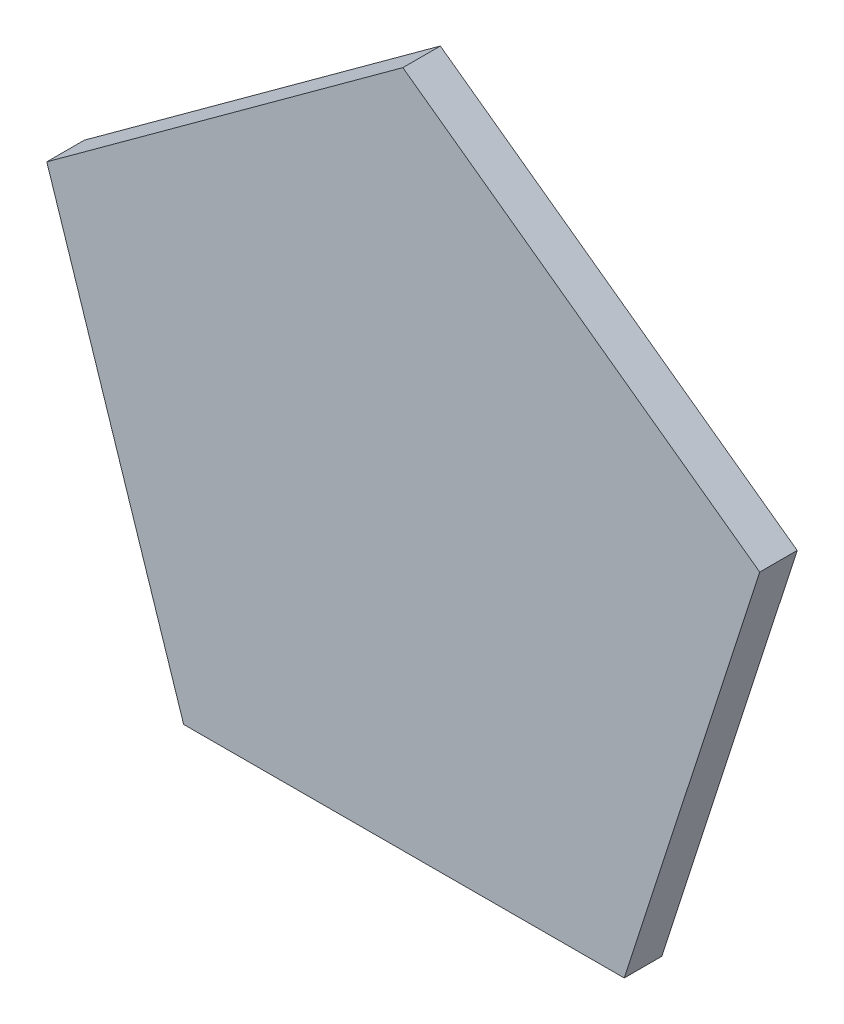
ISO-10303-21;
HEADER;
FILE_DESCRIPTION(('STEP AP214'),'2;1');
FILE_NAME('part.step','',(''),(''),'','','');
FILE_SCHEMA(('AUTOMOTIVE_DESIGN { 1 0 10303 214 1 1 1 1 }'));
ENDSEC;
DATA;
#1=APPLICATION_CONTEXT('core data for automotive mechanical design processes');
#2=APPLICATION_PROTOCOL_DEFINITION('international standard','automotive_design',2000,#1);
#3=PRODUCT_CONTEXT('',#1,'mechanical');
#4=PRODUCT('Part','Part','',(#3));
#5=PRODUCT_RELATED_PRODUCT_CATEGORY('part','',(#4));
#6=PRODUCT_DEFINITION_FORMATION('','',#4);
#7=PRODUCT_DEFINITION_CONTEXT('part definition',#1,'design');
#8=PRODUCT_DEFINITION('design','',#6,#7);
#9=PRODUCT_DEFINITION_SHAPE('','',#8);
#10=(LENGTH_UNIT() NAMED_UNIT(*) SI_UNIT(.MILLI.,.METRE.));
#11=(NAMED_UNIT(*) PLANE_ANGLE_UNIT() SI_UNIT($,.RADIAN.));
#12=(NAMED_UNIT(*) SI_UNIT($,.STERADIAN.) SOLID_ANGLE_UNIT());
#13=UNCERTAINTY_MEASURE_WITH_UNIT(LENGTH_MEASURE(1.E-05),#10,'distance_accuracy_value','');
#14=(GEOMETRIC_REPRESENTATION_CONTEXT(3) GLOBAL_UNCERTAINTY_ASSIGNED_CONTEXT((#13)) GLOBAL_UNIT_ASSIGNED_CONTEXT((#10,
#11,#12)) REPRESENTATION_CONTEXT('',''));
#15=CARTESIAN_POINT('',(0.,0.,0.));
#16=DIRECTION('',(0.,0.,1.));
#17=DIRECTION('',(1.,0.,0.));
#18=AXIS2_PLACEMENT_3D('',#15,#16,#17);
#19=CARTESIAN_POINT('',(-5.8645817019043,-8.09979514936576,1.));
#20=DIRECTION('',(-0.00163938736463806,0.999998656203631,0.));
#21=DIRECTION('',(-0.999998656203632,-0.00163938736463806,0.));
#22=AXIS2_PLACEMENT_3D('',#19,#20,#21);
#23=PLANE('',#22);
#24=DIRECTION('',(0.999998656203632,0.00163938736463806,0.));
#25=VECTOR('',#24,1.);
#26=CARTESIAN_POINT('',(-5.8645817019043,-8.09979514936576,0.));
#27=LINE('',#26,#25);
#28=CARTESIAN_POINT('',(-5.8645817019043,-8.09979514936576,0.));
#29=VERTEX_POINT('',#28);
#30=CARTESIAN_POINT('',(5.89110754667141,-8.08052299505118,0.));
#31=VERTEX_POINT('',#30);
#32=EDGE_CURVE('E295',#29,#31,#27,.T.);
#33=ORIENTED_EDGE('',*,*,#32,.T.);
#34=DIRECTION('',(0.,0.,-1.));
#35=VECTOR('',#34,1.);
#36=CARTESIAN_POINT('',(5.89110754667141,-8.08052299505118,1.));
#37=LINE('',#36,#35);
#38=CARTESIAN_POINT('',(5.89110754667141,-8.08052299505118,1.));
#39=VERTEX_POINT('',#38);
#40=EDGE_CURVE('E11',#39,#31,#37,.T.);
#41=ORIENTED_EDGE('',*,*,#40,.F.);
#42=DIRECTION('',(0.999998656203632,0.00163938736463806,0.));
#43=VECTOR('',#42,1.);
#44=CARTESIAN_POINT('',(-5.8645817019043,-8.09979514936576,1.));
#45=LINE('',#44,#43);
#46=CARTESIAN_POINT('',(-5.8645817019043,-8.09979514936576,1.));
#47=VERTEX_POINT('',#46);
#48=EDGE_CURVE('E300',#47,#39,#45,.T.);
#49=ORIENTED_EDGE('',*,*,#48,.F.);
#50=DIRECTION('',(0.,0.,-1.));
#51=VECTOR('',#50,1.);
#52=CARTESIAN_POINT('',(-5.8645817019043,-8.09979514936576,1.));
#53=LINE('',#52,#51);
#54=EDGE_CURVE('E312',#47,#29,#53,.T.);
#55=ORIENTED_EDGE('',*,*,#54,.T.);
#56=EDGE_LOOP('',(#33,#41,#49,#55));
#57=FACE_BOUND('',#56,.T.);
#58=ADVANCED_FACE('F39',(#57),#23,.F.);
#59=CARTESIAN_POINT('',(5.89110754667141,-8.08052299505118,1.));
#60=DIRECTION('',(-0.951561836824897,0.307457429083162,0.));
#61=DIRECTION('',(-0.307457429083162,-0.951561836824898,0.));
#62=AXIS2_PLACEMENT_3D('',#59,#60,#61);
#63=PLANE('',#62);
#64=DIRECTION('',(0.307457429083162,0.951561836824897,0.));
#65=VECTOR('',#64,1.);
#66=CARTESIAN_POINT('',(5.89110754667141,-8.08052299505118,0.));
#67=LINE('',#66,#65);
#68=CARTESIAN_POINT('',(9.50548639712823,3.10575729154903,0.));
#69=VERTEX_POINT('',#68);
#70=EDGE_CURVE('E315',#31,#69,#67,.T.);
#71=ORIENTED_EDGE('',*,*,#70,.T.);
#72=DIRECTION('',(0.,0.,-1.));
#73=VECTOR('',#72,1.);
#74=CARTESIAN_POINT('',(9.50548639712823,3.10575729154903,1.));
#75=LINE('',#74,#73);
#76=CARTESIAN_POINT('',(9.50548639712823,3.10575729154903,1.));
#77=VERTEX_POINT('',#76);
#78=EDGE_CURVE('E46',#77,#69,#75,.T.);
#79=ORIENTED_EDGE('',*,*,#78,.F.);
#80=DIRECTION('',(0.307457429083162,0.951561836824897,0.));
#81=VECTOR('',#80,1.);
#82=CARTESIAN_POINT('',(5.89110754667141,-8.08052299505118,1.));
#83=LINE('',#82,#81);
#84=EDGE_CURVE('E303',#39,#77,#83,.T.);
#85=ORIENTED_EDGE('',*,*,#84,.F.);
#86=ORIENTED_EDGE('',*,*,#40,.T.);
#87=EDGE_LOOP('',(#71,#79,#85,#86));
#88=FACE_BOUND('',#87,.T.);
#89=ADVANCED_FACE('F353',(#88),#63,.F.);
#90=CARTESIAN_POINT('',(9.50548639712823,3.10575729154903,1.));
#91=DIRECTION('',(-0.58645817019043,-0.809979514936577,0.));
#92=DIRECTION('',(0.809979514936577,-0.58645817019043,0.));
#93=AXIS2_PLACEMENT_3D('',#90,#91,#92);
#94=PLANE('',#93);
#95=DIRECTION('',(-0.809979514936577,0.58645817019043,0.));
#96=VECTOR('',#95,1.);
#97=CARTESIAN_POINT('',(9.50548639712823,3.10575729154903,0.));
#98=LINE('',#97,#96);
#99=CARTESIAN_POINT('',(-0.0163938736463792,9.99998656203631,0.));
#100=VERTEX_POINT('',#99);
#101=EDGE_CURVE('E317',#69,#100,#98,.T.);
#102=ORIENTED_EDGE('',*,*,#101,.T.);
#103=DIRECTION('',(0.,0.,-1.));
#104=VECTOR('',#103,1.);
#105=CARTESIAN_POINT('',(-0.0163938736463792,9.99998656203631,1.));
#106=LINE('',#105,#104);
#107=CARTESIAN_POINT('',(-0.0163938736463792,9.99998656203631,1.));
#108=VERTEX_POINT('',#107);
#109=EDGE_CURVE('E327',#108,#100,#106,.T.);
#110=ORIENTED_EDGE('',*,*,#109,.F.);
#111=DIRECTION('',(-0.809979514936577,0.58645817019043,0.));
#112=VECTOR('',#111,1.);
#113=CARTESIAN_POINT('',(9.50548639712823,3.10575729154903,1.));
#114=LINE('',#113,#112);
#115=EDGE_CURVE('E306',#77,#108,#114,.T.);
#116=ORIENTED_EDGE('',*,*,#115,.F.);
#117=ORIENTED_EDGE('',*,*,#78,.T.);
#118=EDGE_LOOP('',(#102,#110,#116,#117));
#119=FACE_BOUND('',#118,.T.);
#120=ADVANCED_FACE('F334',(#119),#94,.F.);
#121=CARTESIAN_POINT('',(-0.0163938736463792,9.99998656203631,1.));
#122=DIRECTION('',(0.589110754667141,-0.80805229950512,0.));
#123=DIRECTION('',(0.80805229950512,0.589110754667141,0.));
#124=AXIS2_PLACEMENT_3D('',#121,#122,#123);
#125=PLANE('',#124);
#126=DIRECTION('',(-0.80805229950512,-0.589110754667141,0.));
#127=VECTOR('',#126,1.);
#128=CARTESIAN_POINT('',(-0.0163938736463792,9.99998656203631,0.));
#129=LINE('',#128,#127);
#130=CARTESIAN_POINT('',(-9.51561836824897,3.07457429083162,0.));
#131=VERTEX_POINT('',#130);
#132=EDGE_CURVE('E319',#100,#131,#129,.T.);
#133=ORIENTED_EDGE('',*,*,#132,.T.);
#134=DIRECTION('',(0.,0.,-1.));
#135=VECTOR('',#134,1.);
#136=CARTESIAN_POINT('',(-9.51561836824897,3.07457429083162,1.));
#137=LINE('',#136,#135);
#138=CARTESIAN_POINT('',(-9.51561836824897,3.07457429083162,1.));
#139=VERTEX_POINT('',#138);
#140=EDGE_CURVE('E324',#139,#131,#137,.T.);
#141=ORIENTED_EDGE('',*,*,#140,.F.);
#142=DIRECTION('',(-0.80805229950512,-0.589110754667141,0.));
#143=VECTOR('',#142,1.);
#144=CARTESIAN_POINT('',(-0.0163938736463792,9.99998656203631,1.));
#145=LINE('',#144,#143);
#146=EDGE_CURVE('E308',#108,#139,#145,.T.);
#147=ORIENTED_EDGE('',*,*,#146,.F.);
#148=ORIENTED_EDGE('',*,*,#109,.T.);
#149=EDGE_LOOP('',(#133,#141,#147,#148));
#150=FACE_BOUND('',#149,.T.);
#151=ADVANCED_FACE('F343',(#150),#125,.F.);
#152=CARTESIAN_POINT('',(-9.51561836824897,3.07457429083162,1.));
#153=DIRECTION('',(0.950548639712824,0.310575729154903,0.));
#154=DIRECTION('',(-0.310575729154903,0.950548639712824,0.));
#155=AXIS2_PLACEMENT_3D('',#152,#153,#154);
#156=PLANE('',#155);
#157=DIRECTION('',(0.310575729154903,-0.950548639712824,0.));
#158=VECTOR('',#157,1.);
#159=CARTESIAN_POINT('',(-9.51561836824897,3.07457429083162,0.));
#160=LINE('',#159,#158);
#161=EDGE_CURVE('E304',#131,#29,#160,.T.);
#162=ORIENTED_EDGE('',*,*,#161,.T.);
#163=ORIENTED_EDGE('',*,*,#54,.F.);
#164=DIRECTION('',(0.310575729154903,-0.950548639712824,0.));
#165=VECTOR('',#164,1.);
#166=CARTESIAN_POINT('',(-9.51561836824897,3.07457429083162,1.));
#167=LINE('',#166,#165);
#168=EDGE_CURVE('E310',#139,#47,#167,.T.);
#169=ORIENTED_EDGE('',*,*,#168,.F.);
#170=ORIENTED_EDGE('',*,*,#140,.T.);
#171=EDGE_LOOP('',(#162,#163,#169,#170));
#172=FACE_BOUND('',#171,.T.);
#173=ADVANCED_FACE('F347',(#172),#156,.F.);
#174=CARTESIAN_POINT('',(0.,0.,1.));
#175=DIRECTION('',(0.,0.,1.));
#176=DIRECTION('',(1.,0.,0.));
#177=AXIS2_PLACEMENT_3D('',#174,#175,#176);
#178=PLANE('',#177);
#179=ORIENTED_EDGE('',*,*,#48,.T.);
#180=ORIENTED_EDGE('',*,*,#84,.T.);
#181=ORIENTED_EDGE('',*,*,#115,.T.);
#182=ORIENTED_EDGE('',*,*,#146,.T.);
#183=ORIENTED_EDGE('',*,*,#168,.T.);
#184=EDGE_LOOP('',(#179,#180,#181,#182,#183));
#185=FACE_BOUND('',#184,.T.);
#186=ADVANCED_FACE('F351',(#185),#178,.T.);
#187=CARTESIAN_POINT('',(0.,0.,0.));
#188=DIRECTION('',(0.,0.,1.));
#189=DIRECTION('',(1.,0.,0.));
#190=AXIS2_PLACEMENT_3D('',#187,#188,#189);
#191=PLANE('',#190);
#192=DIRECTION('',(-0.314920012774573,0.949118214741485,0.));
#193=VECTOR('',#192,1.);
#194=CARTESIAN_POINT('',(0.199275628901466,9.34999340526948,0.));
#195=LINE('',#194,#193);
#196=CARTESIAN_POINT('',(2.24303910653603,3.19041934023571,0.));
#197=VERTEX_POINT('',#196);
#198=CARTESIAN_POINT('',(0.199275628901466,9.34999340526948,0.));
#199=VERTEX_POINT('',#198);
#200=EDGE_CURVE('E242',#197,#199,#195,.T.);
#201=ORIENTED_EDGE('',*,*,#200,.F.);
#202=DIRECTION('',(-0.999932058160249,0.0116567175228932,0.));
#203=VECTOR('',#202,1.);
#204=CARTESIAN_POINT('',(2.24303910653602,3.19041934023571,0.));
#205=LINE('',#204,#203);
#206=CARTESIAN_POINT('',(8.81226450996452,3.11383853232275,0.));
#207=VERTEX_POINT('',#206);
#208=EDGE_CURVE('E53',#207,#197,#205,.T.);
#209=ORIENTED_EDGE('',*,*,#208,.F.);
#210=DIRECTION('',(0.809979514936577,-0.58645817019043,0.));
#211=VECTOR('',#210,1.);
#212=CARTESIAN_POINT('',(0.199275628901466,9.34999340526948,0.));
#213=LINE('',#212,#211);
#214=EDGE_CURVE('E239',#199,#207,#213,.T.);
#215=ORIENTED_EDGE('',*,*,#214,.F.);
#216=EDGE_LOOP('',(#201,#209,#215));
#217=FACE_BOUND('',#216,.T.);
#218=DIRECTION('',(-0.307457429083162,-0.951561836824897,0.));
#219=VECTOR('',#218,1.);
#220=CARTESIAN_POINT('',(8.94398759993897,2.66894616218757,0.));
#221=LINE('',#220,#219);
#222=CARTESIAN_POINT('',(8.94398759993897,2.66894616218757,0.));
#223=VERTEX_POINT('',#222);
#224=CARTESIAN_POINT('',(5.67368158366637,-7.45244986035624,0.));
#225=VERTEX_POINT('',#224);
#226=EDGE_CURVE('E264',#223,#225,#221,.T.);
#227=ORIENTED_EDGE('',*,*,#226,.F.);
#228=DIRECTION('',(0.789291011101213,0.614019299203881,0.));
#229=VECTOR('',#228,1.);
#230=CARTESIAN_POINT('',(8.94398759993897,2.66894616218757,0.));
#231=LINE('',#230,#229);
#232=CARTESIAN_POINT('',(3.60711496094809,-1.48280870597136,0.));
#233=VERTEX_POINT('',#232);
#234=EDGE_CURVE('E61',#233,#223,#231,.T.);
#235=ORIENTED_EDGE('',*,*,#234,.F.);
#236=DIRECTION('',(-0.327132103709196,0.944978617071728,0.));
#237=VECTOR('',#236,1.);
#238=CARTESIAN_POINT('',(3.60711496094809,-1.48280870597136,0.));
#239=LINE('',#238,#237);
#240=EDGE_CURVE('E261',#225,#233,#239,.T.);
#241=ORIENTED_EDGE('',*,*,#240,.F.);
#242=EDGE_LOOP('',(#227,#235,#241));
#243=FACE_BOUND('',#242,.T.);
#244=DIRECTION('',(-0.322888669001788,-0.946436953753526,0.));
#245=VECTOR('',#244,1.);
#246=CARTESIAN_POINT('',(-5.64963130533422,-7.46974207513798,0.));
#247=LINE('',#246,#245);
#248=CARTESIAN_POINT('',(-3.60711496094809,-1.48280870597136,0.));
#249=VERTEX_POINT('',#248);
#250=CARTESIAN_POINT('',(-5.64963130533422,-7.46974207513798,0.));
#251=VERTEX_POINT('',#250);
#252=EDGE_CURVE('E193',#249,#251,#247,.T.);
#253=ORIENTED_EDGE('',*,*,#252,.F.);
#254=DIRECTION('',(0.791821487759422,-0.610752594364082,0.));
#255=VECTOR('',#254,1.);
#256=CARTESIAN_POINT('',(-3.60711496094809,-1.48280870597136,0.));
#257=LINE('',#256,#255);
#258=CARTESIAN_POINT('',(-8.95302529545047,2.64063155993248,0.));
#259=VERTEX_POINT('',#258);
#260=EDGE_CURVE('E178',#259,#249,#257,.T.);
#261=ORIENTED_EDGE('',*,*,#260,.F.);
#262=DIRECTION('',(-0.310575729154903,0.950548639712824,0.));
#263=VECTOR('',#262,1.);
#264=CARTESIAN_POINT('',(-5.64963130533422,-7.46974207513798,0.));
#265=LINE('',#264,#263);
#266=EDGE_CURVE('E188',#251,#259,#265,.T.);
#267=ORIENTED_EDGE('',*,*,#266,.F.);
#268=EDGE_LOOP('',(#253,#261,#267));
#269=FACE_BOUND('',#268,.T.);
#270=DIRECTION('',(0.815524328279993,-0.578722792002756,0.));
#271=VECTOR('',#270,1.);
#272=CARTESIAN_POINT('',(5.32873415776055,-7.68144440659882,0.));
#273=LINE('',#272,#271);
#274=CARTESIAN_POINT('',(0.,-3.9,0.));
#275=VERTEX_POINT('',#274);
#276=CARTESIAN_POINT('',(5.32873415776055,-7.68144440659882,0.));
#277=VERTEX_POINT('',#276);
#278=EDGE_CURVE('E218',#275,#277,#273,.T.);
#279=ORIENTED_EDGE('',*,*,#278,.F.);
#280=DIRECTION('',(0.813024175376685,0.58222992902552,0.));
#281=VECTOR('',#280,1.);
#282=CARTESIAN_POINT('',(0.,-3.9,0.));
#283=LINE('',#282,#281);
#284=CARTESIAN_POINT('',(-5.30474050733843,-7.69887681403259,0.));
#285=VERTEX_POINT('',#284);
#286=EDGE_CURVE('E222',#285,#275,#283,.T.);
#287=ORIENTED_EDGE('',*,*,#286,.F.);
#288=DIRECTION('',(-0.999998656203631,-0.00163938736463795,0.));
#289=VECTOR('',#288,1.);
#290=CARTESIAN_POINT('',(5.32873415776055,-7.68144440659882,0.));
#291=LINE('',#290,#289);
#292=EDGE_CURVE('E215',#277,#285,#291,.T.);
#293=ORIENTED_EDGE('',*,*,#292,.F.);
#294=EDGE_LOOP('',(#279,#287,#293));
#295=FACE_BOUND('',#294,.T.);
#296=DIRECTION('',(0.80805229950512,0.589110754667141,0.));
#297=VECTOR('',#296,1.);
#298=CARTESIAN_POINT('',(-8.82146228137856,3.08563151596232,0.));
#299=LINE('',#298,#297);
#300=CARTESIAN_POINT('',(-8.82146228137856,3.08563151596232,0.));
#301=VERTEX_POINT('',#300);
#302=CARTESIAN_POINT('',(-0.228923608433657,9.35002423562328,0.));
#303=VERTEX_POINT('',#302);
#304=EDGE_CURVE('E288',#301,#303,#299,.T.);
#305=ORIENTED_EDGE('',*,*,#304,.F.);
#306=DIRECTION('',(-0.999873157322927,-0.0159269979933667,0.));
#307=VECTOR('',#306,1.);
#308=CARTESIAN_POINT('',(-8.82146228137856,3.08563151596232,0.));
#309=LINE('',#308,#307);
#310=CARTESIAN_POINT('',(-2.24303910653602,3.19041934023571,0.));
#311=VERTEX_POINT('',#310);
#312=EDGE_CURVE('E247',#311,#301,#309,.T.);
#313=ORIENTED_EDGE('',*,*,#312,.F.);
#314=DIRECTION('',(-0.31079441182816,-0.950477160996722,0.));
#315=VECTOR('',#314,1.);
#316=CARTESIAN_POINT('',(-2.24303910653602,3.19041934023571,0.));
#317=LINE('',#316,#315);
#318=EDGE_CURVE('E280',#303,#311,#317,.T.);
#319=ORIENTED_EDGE('',*,*,#318,.F.);
#320=EDGE_LOOP('',(#305,#313,#319));
#321=FACE_BOUND('',#320,.T.);
#322=ORIENTED_EDGE('',*,*,#32,.F.);
#323=ORIENTED_EDGE('',*,*,#161,.F.);
#324=ORIENTED_EDGE('',*,*,#132,.F.);
#325=ORIENTED_EDGE('',*,*,#101,.F.);
#326=ORIENTED_EDGE('',*,*,#70,.F.);
#327=EDGE_LOOP('',(#322,#323,#324,#325,#326));
#328=FACE_BOUND('',#327,.T.);
#329=ADVANCED_FACE('F195',(#217,#243,#269,#295,#321,#328),#191,.F.);
#330=CARTESIAN_POINT('',(-8.82146228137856,3.08563151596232,0.5));
#331=DIRECTION('',(0.0159269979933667,-0.999873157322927,0.));
#332=DIRECTION('',(0.999873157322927,0.0159269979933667,0.));
#333=AXIS2_PLACEMENT_3D('',#330,#331,#332);
#334=PLANE('',#333);
#335=ORIENTED_EDGE('',*,*,#312,.T.);
#336=DIRECTION('',(0.,0.,-1.));
#337=VECTOR('',#336,1.);
#338=CARTESIAN_POINT('',(-8.82146228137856,3.08563151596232,0.5));
#339=LINE('',#338,#337);
#340=CARTESIAN_POINT('',(-8.82146228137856,3.08563151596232,0.5));
#341=VERTEX_POINT('',#340);
#342=EDGE_CURVE('E286',#341,#301,#339,.T.);
#343=ORIENTED_EDGE('',*,*,#342,.F.);
#344=DIRECTION('',(-0.999873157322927,-0.0159269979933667,0.));
#345=VECTOR('',#344,1.);
#346=CARTESIAN_POINT('',(-8.82146228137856,3.08563151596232,0.5));
#347=LINE('',#346,#345);
#348=CARTESIAN_POINT('',(-2.24303910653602,3.19041934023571,0.5));
#349=VERTEX_POINT('',#348);
#350=EDGE_CURVE('E276',#349,#341,#347,.T.);
#351=ORIENTED_EDGE('',*,*,#350,.F.);
#352=DIRECTION('',(0.,0.,-1.));
#353=VECTOR('',#352,1.);
#354=CARTESIAN_POINT('',(-2.24303910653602,3.19041934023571,0.5));
#355=LINE('',#354,#353);
#356=EDGE_CURVE('E293',#349,#311,#355,.T.);
#357=ORIENTED_EDGE('',*,*,#356,.T.);
#358=EDGE_LOOP('',(#335,#343,#351,#357));
#359=FACE_BOUND('',#358,.T.);
#360=ADVANCED_FACE('F370',(#359),#334,.F.);
#361=CARTESIAN_POINT('',(-2.24303910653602,3.19041934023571,0.5));
#362=DIRECTION('',(0.950477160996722,-0.31079441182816,0.));
#363=DIRECTION('',(0.31079441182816,0.950477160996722,0.));
#364=AXIS2_PLACEMENT_3D('',#361,#362,#363);
#365=PLANE('',#364);
#366=ORIENTED_EDGE('',*,*,#318,.T.);
#367=ORIENTED_EDGE('',*,*,#356,.F.);
#368=DIRECTION('',(-0.31079441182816,-0.950477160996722,0.));
#369=VECTOR('',#368,1.);
#370=CARTESIAN_POINT('',(-2.24303910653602,3.19041934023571,0.5));
#371=LINE('',#370,#369);
#372=CARTESIAN_POINT('',(-0.228923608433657,9.35002423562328,0.5));
#373=VERTEX_POINT('',#372);
#374=EDGE_CURVE('E283',#373,#349,#371,.T.);
#375=ORIENTED_EDGE('',*,*,#374,.F.);
#376=DIRECTION('',(0.,0.,-1.));
#377=VECTOR('',#376,1.);
#378=CARTESIAN_POINT('',(-0.228923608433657,9.35002423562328,0.5));
#379=LINE('',#378,#377);
#380=EDGE_CURVE('E296',#373,#303,#379,.T.);
#381=ORIENTED_EDGE('',*,*,#380,.T.);
#382=EDGE_LOOP('',(#366,#367,#375,#381));
#383=FACE_BOUND('',#382,.T.);
#384=ADVANCED_FACE('F376',(#383),#365,.F.);
#385=CARTESIAN_POINT('',(-8.82146228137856,3.08563151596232,0.5));
#386=DIRECTION('',(-0.589110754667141,0.80805229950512,0.));
#387=DIRECTION('',(-0.80805229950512,-0.589110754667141,0.));
#388=AXIS2_PLACEMENT_3D('',#385,#386,#387);
#389=PLANE('',#388);
#390=ORIENTED_EDGE('',*,*,#304,.T.);
#391=ORIENTED_EDGE('',*,*,#380,.F.);
#392=DIRECTION('',(0.80805229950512,0.589110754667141,0.));
#393=VECTOR('',#392,1.);
#394=CARTESIAN_POINT('',(-8.82146228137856,3.08563151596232,0.5));
#395=LINE('',#394,#393);
#396=EDGE_CURVE('E279',#341,#373,#395,.T.);
#397=ORIENTED_EDGE('',*,*,#396,.F.);
#398=ORIENTED_EDGE('',*,*,#342,.T.);
#399=EDGE_LOOP('',(#390,#391,#397,#398));
#400=FACE_BOUND('',#399,.T.);
#401=ADVANCED_FACE('F378',(#400),#389,.F.);
#402=CARTESIAN_POINT('',(0.,0.,0.5));
#403=DIRECTION('',(0.,0.,1.));
#404=DIRECTION('',(1.,0.,0.));
#405=AXIS2_PLACEMENT_3D('',#402,#403,#404);
#406=PLANE('',#405);
#407=ORIENTED_EDGE('',*,*,#350,.T.);
#408=ORIENTED_EDGE('',*,*,#396,.T.);
#409=ORIENTED_EDGE('',*,*,#374,.T.);
#410=EDGE_LOOP('',(#407,#408,#409));
#411=FACE_BOUND('',#410,.T.);
#412=ADVANCED_FACE('F381',(#411),#406,.F.);
#413=CARTESIAN_POINT('',(0.,-3.9,0.5));
#414=DIRECTION('',(-0.58222992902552,0.813024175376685,0.));
#415=DIRECTION('',(-0.813024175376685,-0.58222992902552,0.));
#416=AXIS2_PLACEMENT_3D('',#413,#414,#415);
#417=PLANE('',#416);
#418=ORIENTED_EDGE('',*,*,#286,.T.);
#419=DIRECTION('',(0.,0.,-1.));
#420=VECTOR('',#419,1.);
#421=CARTESIAN_POINT('',(0.,-3.9,0.5));
#422=LINE('',#421,#420);
#423=CARTESIAN_POINT('',(0.,-3.9,0.5));
#424=VERTEX_POINT('',#423);
#425=EDGE_CURVE('E210',#424,#275,#422,.T.);
#426=ORIENTED_EDGE('',*,*,#425,.F.);
#427=DIRECTION('',(0.813024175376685,0.58222992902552,0.));
#428=VECTOR('',#427,1.);
#429=CARTESIAN_POINT('',(0.,-3.9,0.5));
#430=LINE('',#429,#428);
#431=CARTESIAN_POINT('',(-5.30474050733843,-7.69887681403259,0.5));
#432=VERTEX_POINT('',#431);
#433=EDGE_CURVE('E219',#432,#424,#430,.T.);
#434=ORIENTED_EDGE('',*,*,#433,.F.);
#435=DIRECTION('',(0.,0.,-1.));
#436=VECTOR('',#435,1.);
#437=CARTESIAN_POINT('',(-5.30474050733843,-7.69887681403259,0.5));
#438=LINE('',#437,#436);
#439=EDGE_CURVE('E197',#432,#285,#438,.T.);
#440=ORIENTED_EDGE('',*,*,#439,.T.);
#441=EDGE_LOOP('',(#418,#426,#434,#440));
#442=FACE_BOUND('',#441,.T.);
#443=ADVANCED_FACE('F388',(#442),#417,.F.);
#444=CARTESIAN_POINT('',(5.32873415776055,-7.68144440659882,0.5));
#445=DIRECTION('',(0.00163938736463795,-0.999998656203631,0.));
#446=DIRECTION('',(0.999998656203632,0.00163938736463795,0.));
#447=AXIS2_PLACEMENT_3D('',#444,#445,#446);
#448=PLANE('',#447);
#449=ORIENTED_EDGE('',*,*,#292,.T.);
#450=ORIENTED_EDGE('',*,*,#439,.F.);
#451=DIRECTION('',(-0.999998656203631,-0.00163938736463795,0.));
#452=VECTOR('',#451,1.);
#453=CARTESIAN_POINT('',(5.32873415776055,-7.68144440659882,0.5));
#454=LINE('',#453,#452);
#455=CARTESIAN_POINT('',(5.32873415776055,-7.68144440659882,0.5));
#456=VERTEX_POINT('',#455);
#457=EDGE_CURVE('E213',#456,#432,#454,.T.);
#458=ORIENTED_EDGE('',*,*,#457,.F.);
#459=DIRECTION('',(0.,0.,-1.));
#460=VECTOR('',#459,1.);
#461=CARTESIAN_POINT('',(5.32873415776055,-7.68144440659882,0.5));
#462=LINE('',#461,#460);
#463=EDGE_CURVE('E199',#456,#277,#462,.T.);
#464=ORIENTED_EDGE('',*,*,#463,.T.);
#465=EDGE_LOOP('',(#449,#450,#458,#464));
#466=FACE_BOUND('',#465,.T.);
#467=ADVANCED_FACE('F426',(#466),#448,.F.);
#468=CARTESIAN_POINT('',(5.32873415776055,-7.68144440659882,0.5));
#469=DIRECTION('',(0.578722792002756,0.815524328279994,0.));
#470=DIRECTION('',(-0.815524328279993,0.578722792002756,0.));
#471=AXIS2_PLACEMENT_3D('',#468,#469,#470);
#472=PLANE('',#471);
#473=ORIENTED_EDGE('',*,*,#278,.T.);
#474=ORIENTED_EDGE('',*,*,#463,.F.);
#475=DIRECTION('',(0.815524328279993,-0.578722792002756,0.));
#476=VECTOR('',#475,1.);
#477=CARTESIAN_POINT('',(5.32873415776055,-7.68144440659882,0.5));
#478=LINE('',#477,#476);
#479=EDGE_CURVE('E227',#424,#456,#478,.T.);
#480=ORIENTED_EDGE('',*,*,#479,.F.);
#481=ORIENTED_EDGE('',*,*,#425,.T.);
#482=EDGE_LOOP('',(#473,#474,#480,#481));
#483=FACE_BOUND('',#482,.T.);
#484=ADVANCED_FACE('F424',(#483),#472,.F.);
#485=CARTESIAN_POINT('',(0.,0.,0.5));
#486=DIRECTION('',(0.,0.,-1.));
#487=DIRECTION('',(-1.,0.,0.));
#488=AXIS2_PLACEMENT_3D('',#485,#486,#487);
#489=PLANE('',#488);
#490=ORIENTED_EDGE('',*,*,#433,.T.);
#491=ORIENTED_EDGE('',*,*,#479,.T.);
#492=ORIENTED_EDGE('',*,*,#457,.T.);
#493=EDGE_LOOP('',(#490,#491,#492));
#494=FACE_BOUND('',#493,.T.);
#495=ADVANCED_FACE('F421',(#494),#489,.T.);
#496=CARTESIAN_POINT('',(-3.60711496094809,-1.48280870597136,0.5));
#497=DIRECTION('',(0.610752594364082,0.791821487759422,0.));
#498=DIRECTION('',(-0.791821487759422,0.610752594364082,0.));
#499=AXIS2_PLACEMENT_3D('',#496,#497,#498);
#500=PLANE('',#499);
#501=ORIENTED_EDGE('',*,*,#260,.T.);
#502=DIRECTION('',(0.,0.,-1.));
#503=VECTOR('',#502,1.);
#504=CARTESIAN_POINT('',(-3.60711496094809,-1.48280870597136,0.5));
#505=LINE('',#504,#503);
#506=CARTESIAN_POINT('',(-3.60711496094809,-1.48280870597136,0.5));
#507=VERTEX_POINT('',#506);
#508=EDGE_CURVE('E206',#507,#249,#505,.T.);
#509=ORIENTED_EDGE('',*,*,#508,.F.);
#510=DIRECTION('',(0.791821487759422,-0.610752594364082,0.));
#511=VECTOR('',#510,1.);
#512=CARTESIAN_POINT('',(-3.60711496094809,-1.48280870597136,0.5));
#513=LINE('',#512,#511);
#514=CARTESIAN_POINT('',(-8.95302529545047,2.64063155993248,0.5));
#515=VERTEX_POINT('',#514);
#516=EDGE_CURVE('E181',#515,#507,#513,.T.);
#517=ORIENTED_EDGE('',*,*,#516,.F.);
#518=DIRECTION('',(0.,0.,-1.));
#519=VECTOR('',#518,1.);
#520=CARTESIAN_POINT('',(-8.95302529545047,2.64063155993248,0.5));
#521=LINE('',#520,#519);
#522=EDGE_CURVE('E174',#515,#259,#521,.T.);
#523=ORIENTED_EDGE('',*,*,#522,.T.);
#524=EDGE_LOOP('',(#501,#509,#517,#523));
#525=FACE_BOUND('',#524,.T.);
#526=ADVANCED_FACE('F176',(#525),#500,.F.);
#527=CARTESIAN_POINT('',(-5.64963130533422,-7.46974207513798,0.5));
#528=DIRECTION('',(-0.950548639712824,-0.310575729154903,0.));
#529=DIRECTION('',(0.310575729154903,-0.950548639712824,0.));
#530=AXIS2_PLACEMENT_3D('',#527,#528,#529);
#531=PLANE('',#530);
#532=ORIENTED_EDGE('',*,*,#266,.T.);
#533=ORIENTED_EDGE('',*,*,#522,.F.);
#534=DIRECTION('',(-0.310575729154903,0.950548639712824,0.));
#535=VECTOR('',#534,1.);
#536=CARTESIAN_POINT('',(-5.64963130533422,-7.46974207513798,0.5));
#537=LINE('',#536,#535);
#538=CARTESIAN_POINT('',(-5.64963130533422,-7.46974207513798,0.5));
#539=VERTEX_POINT('',#538);
#540=EDGE_CURVE('E203',#539,#515,#537,.T.);
#541=ORIENTED_EDGE('',*,*,#540,.F.);
#542=DIRECTION('',(0.,0.,-1.));
#543=VECTOR('',#542,1.);
#544=CARTESIAN_POINT('',(-5.64963130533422,-7.46974207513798,0.5));
#545=LINE('',#544,#543);
#546=EDGE_CURVE('E185',#539,#251,#545,.T.);
#547=ORIENTED_EDGE('',*,*,#546,.T.);
#548=EDGE_LOOP('',(#532,#533,#541,#547));
#549=FACE_BOUND('',#548,.T.);
#550=ADVANCED_FACE('F189',(#549),#531,.F.);
#551=CARTESIAN_POINT('',(-5.64963130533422,-7.46974207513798,0.5));
#552=DIRECTION('',(0.946436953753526,-0.322888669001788,0.));
#553=DIRECTION('',(0.322888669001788,0.946436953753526,0.));
#554=AXIS2_PLACEMENT_3D('',#551,#552,#553);
#555=PLANE('',#554);
#556=ORIENTED_EDGE('',*,*,#252,.T.);
#557=ORIENTED_EDGE('',*,*,#546,.F.);
#558=DIRECTION('',(-0.322888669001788,-0.946436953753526,0.));
#559=VECTOR('',#558,1.);
#560=CARTESIAN_POINT('',(-5.64963130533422,-7.46974207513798,0.5));
#561=LINE('',#560,#559);
#562=EDGE_CURVE('E205',#507,#539,#561,.T.);
#563=ORIENTED_EDGE('',*,*,#562,.F.);
#564=ORIENTED_EDGE('',*,*,#508,.T.);
#565=EDGE_LOOP('',(#556,#557,#563,#564));
#566=FACE_BOUND('',#565,.T.);
#567=ADVANCED_FACE('F438',(#566),#555,.F.);
#568=CARTESIAN_POINT('',(0.,0.,0.5));
#569=DIRECTION('',(0.,0.,-1.));
#570=DIRECTION('',(-1.,0.,0.));
#571=AXIS2_PLACEMENT_3D('',#568,#569,#570);
#572=PLANE('',#571);
#573=ORIENTED_EDGE('',*,*,#516,.T.);
#574=ORIENTED_EDGE('',*,*,#562,.T.);
#575=ORIENTED_EDGE('',*,*,#540,.T.);
#576=EDGE_LOOP('',(#573,#574,#575));
#577=FACE_BOUND('',#576,.T.);
#578=ADVANCED_FACE('F406',(#577),#572,.T.);
#579=CARTESIAN_POINT('',(8.94398759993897,2.66894616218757,0.5));
#580=DIRECTION('',(-0.614019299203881,0.789291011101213,0.));
#581=DIRECTION('',(-0.789291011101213,-0.614019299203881,0.));
#582=AXIS2_PLACEMENT_3D('',#579,#580,#581);
#583=PLANE('',#582);
#584=ORIENTED_EDGE('',*,*,#234,.T.);
#585=DIRECTION('',(0.,0.,-1.));
#586=VECTOR('',#585,1.);
#587=CARTESIAN_POINT('',(8.94398759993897,2.66894616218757,0.5));
#588=LINE('',#587,#586);
#589=CARTESIAN_POINT('',(8.94398759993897,2.66894616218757,0.5));
#590=VERTEX_POINT('',#589);
#591=EDGE_CURVE('E255',#590,#223,#588,.T.);
#592=ORIENTED_EDGE('',*,*,#591,.F.);
#593=DIRECTION('',(0.789291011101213,0.614019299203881,0.));
#594=VECTOR('',#593,1.);
#595=CARTESIAN_POINT('',(8.94398759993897,2.66894616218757,0.5));
#596=LINE('',#595,#594);
#597=CARTESIAN_POINT('',(3.60711496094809,-1.48280870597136,0.5));
#598=VERTEX_POINT('',#597);
#599=EDGE_CURVE('E265',#598,#590,#596,.T.);
#600=ORIENTED_EDGE('',*,*,#599,.F.);
#601=DIRECTION('',(0.,0.,-1.));
#602=VECTOR('',#601,1.);
#603=CARTESIAN_POINT('',(3.60711496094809,-1.48280870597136,0.5));
#604=LINE('',#603,#602);
#605=EDGE_CURVE('E224',#598,#233,#604,.T.);
#606=ORIENTED_EDGE('',*,*,#605,.T.);
#607=EDGE_LOOP('',(#584,#592,#600,#606));
#608=FACE_BOUND('',#607,.T.);
#609=ADVANCED_FACE('F399',(#608),#583,.F.);
#610=CARTESIAN_POINT('',(3.60711496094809,-1.48280870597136,0.5));
#611=DIRECTION('',(-0.944978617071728,-0.327132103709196,0.));
#612=DIRECTION('',(0.327132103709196,-0.944978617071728,0.));
#613=AXIS2_PLACEMENT_3D('',#610,#611,#612);
#614=PLANE('',#613);
#615=ORIENTED_EDGE('',*,*,#240,.T.);
#616=ORIENTED_EDGE('',*,*,#605,.F.);
#617=DIRECTION('',(-0.327132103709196,0.944978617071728,0.));
#618=VECTOR('',#617,1.);
#619=CARTESIAN_POINT('',(3.60711496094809,-1.48280870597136,0.5));
#620=LINE('',#619,#618);
#621=CARTESIAN_POINT('',(5.67368158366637,-7.45244986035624,0.5));
#622=VERTEX_POINT('',#621);
#623=EDGE_CURVE('E257',#622,#598,#620,.T.);
#624=ORIENTED_EDGE('',*,*,#623,.F.);
#625=DIRECTION('',(0.,0.,-1.));
#626=VECTOR('',#625,1.);
#627=CARTESIAN_POINT('',(5.67368158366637,-7.45244986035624,0.5));
#628=LINE('',#627,#626);
#629=EDGE_CURVE('E258',#622,#225,#628,.T.);
#630=ORIENTED_EDGE('',*,*,#629,.T.);
#631=EDGE_LOOP('',(#615,#616,#624,#630));
#632=FACE_BOUND('',#631,.T.);
#633=ADVANCED_FACE('F396',(#632),#614,.F.);
#634=CARTESIAN_POINT('',(8.94398759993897,2.66894616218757,0.5));
#635=DIRECTION('',(0.951561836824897,-0.307457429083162,0.));
#636=DIRECTION('',(0.307457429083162,0.951561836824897,0.));
#637=AXIS2_PLACEMENT_3D('',#634,#635,#636);
#638=PLANE('',#637);
#639=ORIENTED_EDGE('',*,*,#226,.T.);
#640=ORIENTED_EDGE('',*,*,#629,.F.);
#641=DIRECTION('',(-0.307457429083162,-0.951561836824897,0.));
#642=VECTOR('',#641,1.);
#643=CARTESIAN_POINT('',(8.94398759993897,2.66894616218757,0.5));
#644=LINE('',#643,#642);
#645=EDGE_CURVE('E271',#590,#622,#644,.T.);
#646=ORIENTED_EDGE('',*,*,#645,.F.);
#647=ORIENTED_EDGE('',*,*,#591,.T.);
#648=EDGE_LOOP('',(#639,#640,#646,#647));
#649=FACE_BOUND('',#648,.T.);
#650=ADVANCED_FACE('F394',(#649),#638,.F.);
#651=CARTESIAN_POINT('',(0.,0.,0.5));
#652=DIRECTION('',(0.,0.,1.));
#653=DIRECTION('',(1.,0.,0.));
#654=AXIS2_PLACEMENT_3D('',#651,#652,#653);
#655=PLANE('',#654);
#656=ORIENTED_EDGE('',*,*,#599,.T.);
#657=ORIENTED_EDGE('',*,*,#645,.T.);
#658=ORIENTED_EDGE('',*,*,#623,.T.);
#659=EDGE_LOOP('',(#656,#657,#658));
#660=FACE_BOUND('',#659,.T.);
#661=ADVANCED_FACE('F390',(#660),#655,.F.);
#662=CARTESIAN_POINT('',(2.24303910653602,3.19041934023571,0.5));
#663=DIRECTION('',(-0.0116567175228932,-0.999932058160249,0.));
#664=DIRECTION('',(0.999932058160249,-0.0116567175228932,0.));
#665=AXIS2_PLACEMENT_3D('',#662,#663,#664);
#666=PLANE('',#665);
#667=ORIENTED_EDGE('',*,*,#208,.T.);
#668=DIRECTION('',(0.,0.,-1.));
#669=VECTOR('',#668,1.);
#670=CARTESIAN_POINT('',(2.24303910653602,3.19041934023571,0.5));
#671=LINE('',#670,#669);
#672=CARTESIAN_POINT('',(2.24303910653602,3.19041934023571,0.5));
#673=VERTEX_POINT('',#672);
#674=EDGE_CURVE('E232',#673,#197,#671,.T.);
#675=ORIENTED_EDGE('',*,*,#674,.F.);
#676=DIRECTION('',(-0.999932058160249,0.0116567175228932,0.));
#677=VECTOR('',#676,1.);
#678=CARTESIAN_POINT('',(2.24303910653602,3.19041934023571,0.5));
#679=LINE('',#678,#677);
#680=CARTESIAN_POINT('',(8.81226450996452,3.11383853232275,0.5));
#681=VERTEX_POINT('',#680);
#682=EDGE_CURVE('E243',#681,#673,#679,.T.);
#683=ORIENTED_EDGE('',*,*,#682,.F.);
#684=DIRECTION('',(0.,0.,-1.));
#685=VECTOR('',#684,1.);
#686=CARTESIAN_POINT('',(8.81226450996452,3.11383853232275,0.5));
#687=LINE('',#686,#685);
#688=EDGE_CURVE('E237',#681,#207,#687,.T.);
#689=ORIENTED_EDGE('',*,*,#688,.T.);
#690=EDGE_LOOP('',(#667,#675,#683,#689));
#691=FACE_BOUND('',#690,.T.);
#692=ADVANCED_FACE('F393',(#691),#666,.F.);
#693=CARTESIAN_POINT('',(0.199275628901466,9.34999340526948,0.5));
#694=DIRECTION('',(0.58645817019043,0.809979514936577,0.));
#695=DIRECTION('',(-0.809979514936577,0.58645817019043,0.));
#696=AXIS2_PLACEMENT_3D('',#693,#694,#695);
#697=PLANE('',#696);
#698=ORIENTED_EDGE('',*,*,#214,.T.);
#699=ORIENTED_EDGE('',*,*,#688,.F.);
#700=DIRECTION('',(0.809979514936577,-0.58645817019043,0.));
#701=VECTOR('',#700,1.);
#702=CARTESIAN_POINT('',(0.199275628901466,9.34999340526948,0.5));
#703=LINE('',#702,#701);
#704=CARTESIAN_POINT('',(0.199275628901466,9.34999340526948,0.5));
#705=VERTEX_POINT('',#704);
#706=EDGE_CURVE('E234',#705,#681,#703,.T.);
#707=ORIENTED_EDGE('',*,*,#706,.F.);
#708=DIRECTION('',(0.,0.,-1.));
#709=VECTOR('',#708,1.);
#710=CARTESIAN_POINT('',(0.199275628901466,9.34999340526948,0.5));
#711=LINE('',#710,#709);
#712=EDGE_CURVE('E235',#705,#199,#711,.T.);
#713=ORIENTED_EDGE('',*,*,#712,.T.);
#714=EDGE_LOOP('',(#698,#699,#707,#713));
#715=FACE_BOUND('',#714,.T.);
#716=ADVANCED_FACE('F412',(#715),#697,.F.);
#717=CARTESIAN_POINT('',(0.199275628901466,9.34999340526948,0.5));
#718=DIRECTION('',(-0.949118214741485,-0.314920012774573,0.));
#719=DIRECTION('',(0.314920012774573,-0.949118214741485,0.));
#720=AXIS2_PLACEMENT_3D('',#717,#718,#719);
#721=PLANE('',#720);
#722=ORIENTED_EDGE('',*,*,#200,.T.);
#723=ORIENTED_EDGE('',*,*,#712,.F.);
#724=DIRECTION('',(-0.314920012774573,0.949118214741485,0.));
#725=VECTOR('',#724,1.);
#726=CARTESIAN_POINT('',(0.199275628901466,9.34999340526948,0.5));
#727=LINE('',#726,#725);
#728=EDGE_CURVE('E250',#673,#705,#727,.T.);
#729=ORIENTED_EDGE('',*,*,#728,.F.);
#730=ORIENTED_EDGE('',*,*,#674,.T.);
#731=EDGE_LOOP('',(#722,#723,#729,#730));
#732=FACE_BOUND('',#731,.T.);
#733=ADVANCED_FACE('F410',(#732),#721,.F.);
#734=CARTESIAN_POINT('',(0.,0.,0.5));
#735=DIRECTION('',(0.,0.,-1.));
#736=DIRECTION('',(-1.,0.,0.));
#737=AXIS2_PLACEMENT_3D('',#734,#735,#736);
#738=PLANE('',#737);
#739=ORIENTED_EDGE('',*,*,#682,.T.);
#740=ORIENTED_EDGE('',*,*,#728,.T.);
#741=ORIENTED_EDGE('',*,*,#706,.T.);
#742=EDGE_LOOP('',(#739,#740,#741));
#743=FACE_BOUND('',#742,.T.);
#744=ADVANCED_FACE('F407',(#743),#738,.T.);
#745=CLOSED_SHELL('',(#58,#89,#120,#151,#173,#186,#329,#360,#384,#401,#412,#443,#467,#484,#495,
#526,#550,#567,#578,#609,#633,#650,#661,#692,#716,#733,#744));
#746=MANIFOLD_SOLID_BREP('B2',#745);
#747=ADVANCED_BREP_SHAPE_REPRESENTATION('',(#18,#746),#14);
#748=SHAPE_DEFINITION_REPRESENTATION(#9,#747);
ENDSEC;
END-ISO-10303-21;
